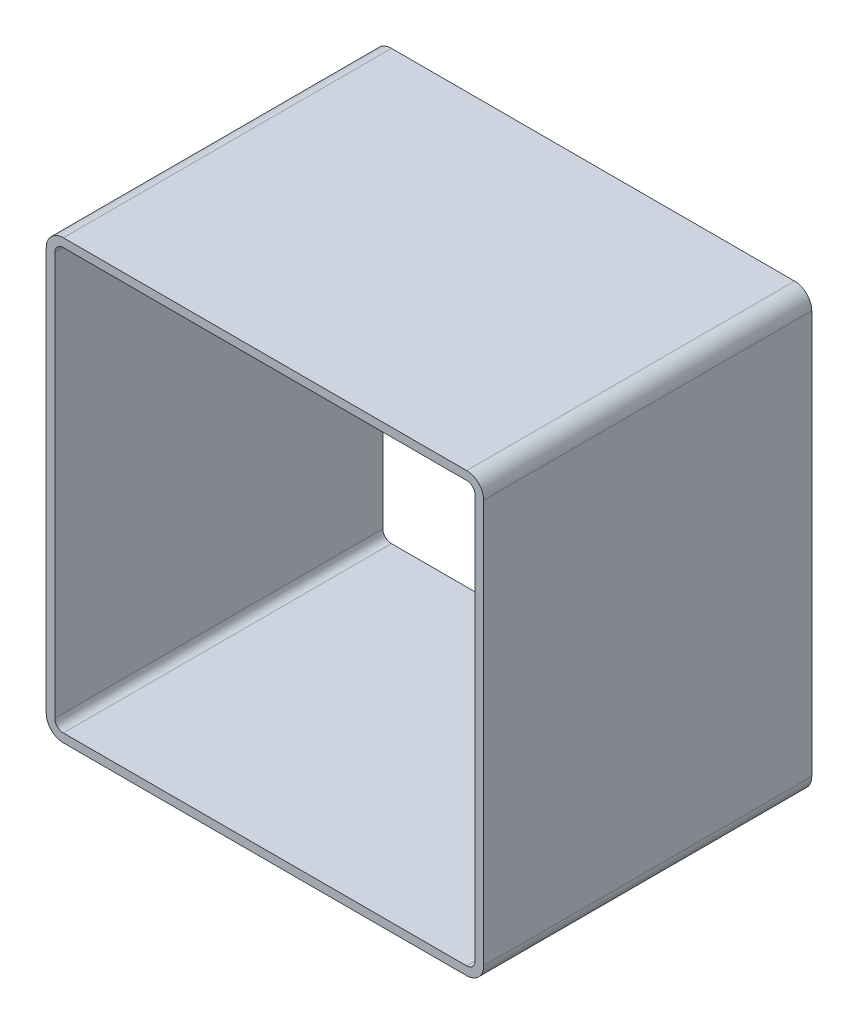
ISO-10303-21;
HEADER;
FILE_DESCRIPTION(('STEP AP214'),'2;1');
FILE_NAME('part.step','',(''),(''),'','','');
FILE_SCHEMA(('AUTOMOTIVE_DESIGN { 1 0 10303 214 1 1 1 1 }'));
ENDSEC;
DATA;
#1=APPLICATION_CONTEXT('core data for automotive mechanical design processes');
#2=APPLICATION_PROTOCOL_DEFINITION('international standard','automotive_design',2000,#1);
#3=PRODUCT_CONTEXT('',#1,'mechanical');
#4=PRODUCT('Part','Part','',(#3));
#5=PRODUCT_RELATED_PRODUCT_CATEGORY('part','',(#4));
#6=PRODUCT_DEFINITION_FORMATION('','',#4);
#7=PRODUCT_DEFINITION_CONTEXT('part definition',#1,'design');
#8=PRODUCT_DEFINITION('design','',#6,#7);
#9=PRODUCT_DEFINITION_SHAPE('','',#8);
#10=(LENGTH_UNIT() NAMED_UNIT(*) SI_UNIT(.MILLI.,.METRE.));
#11=(NAMED_UNIT(*) PLANE_ANGLE_UNIT() SI_UNIT($,.RADIAN.));
#12=(NAMED_UNIT(*) SI_UNIT($,.STERADIAN.) SOLID_ANGLE_UNIT());
#13=UNCERTAINTY_MEASURE_WITH_UNIT(LENGTH_MEASURE(1.E-05),#10,'distance_accuracy_value','');
#14=(GEOMETRIC_REPRESENTATION_CONTEXT(3) GLOBAL_UNCERTAINTY_ASSIGNED_CONTEXT((#13)) GLOBAL_UNIT_ASSIGNED_CONTEXT((#10,
#11,#12)) REPRESENTATION_CONTEXT('',''));
#15=CARTESIAN_POINT('',(0.,0.,0.));
#16=DIRECTION('',(0.,0.,1.));
#17=DIRECTION('',(1.,0.,0.));
#18=AXIS2_PLACEMENT_3D('',#15,#16,#17);
#19=CARTESIAN_POINT('',(16.697465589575,392.307862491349,304.8));
#20=DIRECTION('',(0.,0.,1.));
#21=DIRECTION('',(1.,0.,0.));
#22=AXIS2_PLACEMENT_3D('',#19,#20,#21);
#23=PLANE('',#22);
#24=CARTESIAN_POINT('',(16.697465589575,392.307862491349,304.8));
#25=DIRECTION('',(0.,0.,1.));
#26=DIRECTION('',(1.,0.,0.));
#27=AXIS2_PLACEMENT_3D('',#24,#25,#26);
#28=CIRCLE('',#27,15.875);
#29=CARTESIAN_POINT('',(16.697465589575,408.182862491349,304.8));
#30=VERTEX_POINT('',#29);
#31=CARTESIAN_POINT('',(0.82246558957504,392.307862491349,304.8));
#32=VERTEX_POINT('',#31);
#33=EDGE_CURVE('E211',#30,#32,#28,.T.);
#34=ORIENTED_EDGE('',*,*,#33,.T.);
#35=DIRECTION('',(0.,-1.,0.));
#36=VECTOR('',#35,1.);
#37=CARTESIAN_POINT('',(0.82246558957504,17.6578624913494,304.8));
#38=LINE('',#37,#36);
#39=CARTESIAN_POINT('',(0.822465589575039,17.6578624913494,304.8));
#40=VERTEX_POINT('',#39);
#41=EDGE_CURVE('E214',#32,#40,#38,.T.);
#42=ORIENTED_EDGE('',*,*,#41,.T.);
#43=CARTESIAN_POINT('',(16.697465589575,17.6578624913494,304.8));
#44=DIRECTION('',(0.,0.,1.));
#45=DIRECTION('',(1.,0.,0.));
#46=AXIS2_PLACEMENT_3D('',#43,#44,#45);
#47=CIRCLE('',#46,15.875);
#48=CARTESIAN_POINT('',(16.697465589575,1.78286249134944,304.8));
#49=VERTEX_POINT('',#48);
#50=EDGE_CURVE('E217',#40,#49,#47,.T.);
#51=ORIENTED_EDGE('',*,*,#50,.T.);
#52=DIRECTION('',(1.,0.,0.));
#53=VECTOR('',#52,1.);
#54=CARTESIAN_POINT('',(391.347465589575,1.78286249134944,304.8));
#55=LINE('',#54,#53);
#56=CARTESIAN_POINT('',(391.347465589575,1.78286249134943,304.8));
#57=VERTEX_POINT('',#56);
#58=EDGE_CURVE('E219',#49,#57,#55,.T.);
#59=ORIENTED_EDGE('',*,*,#58,.T.);
#60=CARTESIAN_POINT('',(391.347465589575,17.6578624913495,304.8));
#61=DIRECTION('',(0.,0.,1.));
#62=DIRECTION('',(1.,0.,0.));
#63=AXIS2_PLACEMENT_3D('',#60,#61,#62);
#64=CIRCLE('',#63,15.875);
#65=CARTESIAN_POINT('',(407.222465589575,17.6578624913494,304.8));
#66=VERTEX_POINT('',#65);
#67=EDGE_CURVE('E221',#57,#66,#64,.T.);
#68=ORIENTED_EDGE('',*,*,#67,.T.);
#69=DIRECTION('',(0.,1.,0.));
#70=VECTOR('',#69,1.);
#71=CARTESIAN_POINT('',(407.222465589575,392.307862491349,304.8));
#72=LINE('',#71,#70);
#73=CARTESIAN_POINT('',(407.222465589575,392.307862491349,304.8));
#74=VERTEX_POINT('',#73);
#75=EDGE_CURVE('E223',#66,#74,#72,.T.);
#76=ORIENTED_EDGE('',*,*,#75,.T.);
#77=CARTESIAN_POINT('',(391.347465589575,392.307862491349,304.8));
#78=DIRECTION('',(0.,0.,1.));
#79=DIRECTION('',(1.,0.,0.));
#80=AXIS2_PLACEMENT_3D('',#77,#78,#79);
#81=CIRCLE('',#80,15.875);
#82=CARTESIAN_POINT('',(391.347465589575,408.182862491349,304.8));
#83=VERTEX_POINT('',#82);
#84=EDGE_CURVE('E225',#74,#83,#81,.T.);
#85=ORIENTED_EDGE('',*,*,#84,.T.);
#86=DIRECTION('',(-1.,0.,0.));
#87=VECTOR('',#86,1.);
#88=CARTESIAN_POINT('',(16.697465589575,408.182862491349,304.8));
#89=LINE('',#88,#87);
#90=EDGE_CURVE('E227',#83,#30,#89,.T.);
#91=ORIENTED_EDGE('',*,*,#90,.T.);
#92=EDGE_LOOP('',(#34,#42,#51,#59,#68,#76,#85,#91));
#93=FACE_BOUND('',#92,.T.);
#94=DIRECTION('',(0.,-1.,0.));
#95=VECTOR('',#94,1.);
#96=CARTESIAN_POINT('',(8.75996558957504,17.6578624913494,304.8));
#97=LINE('',#96,#95);
#98=CARTESIAN_POINT('',(8.75996558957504,392.307862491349,304.8));
#99=VERTEX_POINT('',#98);
#100=CARTESIAN_POINT('',(8.75996558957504,17.6578624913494,304.8));
#101=VERTEX_POINT('',#100);
#102=EDGE_CURVE('E154',#99,#101,#97,.T.);
#103=ORIENTED_EDGE('',*,*,#102,.F.);
#104=CARTESIAN_POINT('',(16.697465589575,392.307862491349,304.8));
#105=DIRECTION('',(0.,0.,1.));
#106=DIRECTION('',(1.,0.,0.));
#107=AXIS2_PLACEMENT_3D('',#104,#105,#106);
#108=CIRCLE('',#107,7.93749999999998);
#109=CARTESIAN_POINT('',(16.697465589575,400.245362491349,304.8));
#110=VERTEX_POINT('',#109);
#111=EDGE_CURVE('E146',#110,#99,#108,.T.);
#112=ORIENTED_EDGE('',*,*,#111,.F.);
#113=DIRECTION('',(-1.,0.,0.));
#114=VECTOR('',#113,1.);
#115=CARTESIAN_POINT('',(16.697465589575,400.245362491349,304.8));
#116=LINE('',#115,#114);
#117=CARTESIAN_POINT('',(391.347465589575,400.245362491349,304.8));
#118=VERTEX_POINT('',#117);
#119=EDGE_CURVE('E179',#118,#110,#116,.T.);
#120=ORIENTED_EDGE('',*,*,#119,.F.);
#121=CARTESIAN_POINT('',(391.347465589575,392.307862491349,304.8));
#122=DIRECTION('',(0.,0.,1.));
#123=DIRECTION('',(1.,0.,0.));
#124=AXIS2_PLACEMENT_3D('',#121,#122,#123);
#125=CIRCLE('',#124,7.93749999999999);
#126=CARTESIAN_POINT('',(399.284965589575,392.307862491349,304.8));
#127=VERTEX_POINT('',#126);
#128=EDGE_CURVE('E177',#127,#118,#125,.T.);
#129=ORIENTED_EDGE('',*,*,#128,.F.);
#130=DIRECTION('',(0.,1.,0.));
#131=VECTOR('',#130,1.);
#132=CARTESIAN_POINT('',(399.284965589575,392.307862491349,304.8));
#133=LINE('',#132,#131);
#134=CARTESIAN_POINT('',(399.284965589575,17.6578624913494,304.8));
#135=VERTEX_POINT('',#134);
#136=EDGE_CURVE('E175',#135,#127,#133,.T.);
#137=ORIENTED_EDGE('',*,*,#136,.F.);
#138=CARTESIAN_POINT('',(391.347465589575,17.6578624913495,304.8));
#139=DIRECTION('',(0.,0.,1.));
#140=DIRECTION('',(1.,0.,0.));
#141=AXIS2_PLACEMENT_3D('',#138,#139,#140);
#142=CIRCLE('',#141,7.9375);
#143=CARTESIAN_POINT('',(391.347465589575,9.72036249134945,304.8));
#144=VERTEX_POINT('',#143);
#145=EDGE_CURVE('E173',#144,#135,#142,.T.);
#146=ORIENTED_EDGE('',*,*,#145,.F.);
#147=DIRECTION('',(1.,0.,0.));
#148=VECTOR('',#147,1.);
#149=CARTESIAN_POINT('',(391.347465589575,9.72036249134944,304.8));
#150=LINE('',#149,#148);
#151=CARTESIAN_POINT('',(16.697465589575,9.72036249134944,304.8));
#152=VERTEX_POINT('',#151);
#153=EDGE_CURVE('E169',#152,#144,#150,.T.);
#154=ORIENTED_EDGE('',*,*,#153,.F.);
#155=CARTESIAN_POINT('',(16.697465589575,17.6578624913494,304.8));
#156=DIRECTION('',(0.,0.,1.));
#157=DIRECTION('',(1.,0.,0.));
#158=AXIS2_PLACEMENT_3D('',#155,#156,#157);
#159=CIRCLE('',#158,7.9375);
#160=EDGE_CURVE('E167',#101,#152,#159,.T.);
#161=ORIENTED_EDGE('',*,*,#160,.F.);
#162=EDGE_LOOP('',(#103,#112,#120,#129,#137,#146,#154,#161));
#163=FACE_BOUND('',#162,.T.);
#164=ADVANCED_FACE('F33',(#93,#163),#23,.T.);
#165=CARTESIAN_POINT('',(16.697465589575,392.307862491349,0.));
#166=DIRECTION('',(0.,0.,1.));
#167=DIRECTION('',(1.,0.,0.));
#168=AXIS2_PLACEMENT_3D('',#165,#166,#167);
#169=PLANE('',#168);
#170=CARTESIAN_POINT('',(16.697465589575,392.307862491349,0.));
#171=DIRECTION('',(0.,0.,1.));
#172=DIRECTION('',(1.,0.,0.));
#173=AXIS2_PLACEMENT_3D('',#170,#171,#172);
#174=CIRCLE('',#173,15.875);
#175=CARTESIAN_POINT('',(16.697465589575,408.182862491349,0.));
#176=VERTEX_POINT('',#175);
#177=CARTESIAN_POINT('',(0.82246558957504,392.307862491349,0.));
#178=VERTEX_POINT('',#177);
#179=EDGE_CURVE('E162',#176,#178,#174,.T.);
#180=ORIENTED_EDGE('',*,*,#179,.F.);
#181=DIRECTION('',(-1.,0.,0.));
#182=VECTOR('',#181,1.);
#183=CARTESIAN_POINT('',(16.697465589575,408.182862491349,0.));
#184=LINE('',#183,#182);
#185=CARTESIAN_POINT('',(391.347465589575,408.182862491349,0.));
#186=VERTEX_POINT('',#185);
#187=EDGE_CURVE('E215',#186,#176,#184,.T.);
#188=ORIENTED_EDGE('',*,*,#187,.F.);
#189=CARTESIAN_POINT('',(391.347465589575,392.307862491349,0.));
#190=DIRECTION('',(0.,0.,1.));
#191=DIRECTION('',(1.,0.,0.));
#192=AXIS2_PLACEMENT_3D('',#189,#190,#191);
#193=CIRCLE('',#192,15.875);
#194=CARTESIAN_POINT('',(407.222465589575,392.307862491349,0.));
#195=VERTEX_POINT('',#194);
#196=EDGE_CURVE('E242',#195,#186,#193,.T.);
#197=ORIENTED_EDGE('',*,*,#196,.F.);
#198=DIRECTION('',(0.,1.,0.));
#199=VECTOR('',#198,1.);
#200=CARTESIAN_POINT('',(407.222465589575,392.307862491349,0.));
#201=LINE('',#200,#199);
#202=CARTESIAN_POINT('',(407.222465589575,17.6578624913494,0.));
#203=VERTEX_POINT('',#202);
#204=EDGE_CURVE('E240',#203,#195,#201,.T.);
#205=ORIENTED_EDGE('',*,*,#204,.F.);
#206=CARTESIAN_POINT('',(391.347465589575,17.6578624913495,0.));
#207=DIRECTION('',(0.,0.,1.));
#208=DIRECTION('',(1.,0.,0.));
#209=AXIS2_PLACEMENT_3D('',#206,#207,#208);
#210=CIRCLE('',#209,15.875);
#211=CARTESIAN_POINT('',(391.347465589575,1.78286249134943,0.));
#212=VERTEX_POINT('',#211);
#213=EDGE_CURVE('E238',#212,#203,#210,.T.);
#214=ORIENTED_EDGE('',*,*,#213,.F.);
#215=DIRECTION('',(1.,0.,0.));
#216=VECTOR('',#215,1.);
#217=CARTESIAN_POINT('',(391.347465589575,1.78286249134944,0.));
#218=LINE('',#217,#216);
#219=CARTESIAN_POINT('',(16.697465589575,1.78286249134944,0.));
#220=VERTEX_POINT('',#219);
#221=EDGE_CURVE('E236',#220,#212,#218,.T.);
#222=ORIENTED_EDGE('',*,*,#221,.F.);
#223=CARTESIAN_POINT('',(16.697465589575,17.6578624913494,0.));
#224=DIRECTION('',(0.,0.,1.));
#225=DIRECTION('',(1.,0.,0.));
#226=AXIS2_PLACEMENT_3D('',#223,#224,#225);
#227=CIRCLE('',#226,15.875);
#228=CARTESIAN_POINT('',(0.822465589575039,17.6578624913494,0.));
#229=VERTEX_POINT('',#228);
#230=EDGE_CURVE('E234',#229,#220,#227,.T.);
#231=ORIENTED_EDGE('',*,*,#230,.F.);
#232=DIRECTION('',(0.,-1.,0.));
#233=VECTOR('',#232,1.);
#234=CARTESIAN_POINT('',(0.82246558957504,17.6578624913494,0.));
#235=LINE('',#234,#233);
#236=EDGE_CURVE('E232',#178,#229,#235,.T.);
#237=ORIENTED_EDGE('',*,*,#236,.F.);
#238=EDGE_LOOP('',(#180,#188,#197,#205,#214,#222,#231,#237));
#239=FACE_BOUND('',#238,.T.);
#240=CARTESIAN_POINT('',(16.697465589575,392.307862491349,0.));
#241=DIRECTION('',(0.,0.,1.));
#242=DIRECTION('',(1.,0.,0.));
#243=AXIS2_PLACEMENT_3D('',#240,#241,#242);
#244=CIRCLE('',#243,7.93749999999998);
#245=CARTESIAN_POINT('',(16.697465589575,400.245362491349,0.));
#246=VERTEX_POINT('',#245);
#247=CARTESIAN_POINT('',(8.75996558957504,392.307862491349,0.));
#248=VERTEX_POINT('',#247);
#249=EDGE_CURVE('E56',#246,#248,#244,.T.);
#250=ORIENTED_EDGE('',*,*,#249,.T.);
#251=DIRECTION('',(0.,-1.,0.));
#252=VECTOR('',#251,1.);
#253=CARTESIAN_POINT('',(8.75996558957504,17.6578624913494,0.));
#254=LINE('',#253,#252);
#255=CARTESIAN_POINT('',(8.75996558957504,17.6578624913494,0.));
#256=VERTEX_POINT('',#255);
#257=EDGE_CURVE('E161',#248,#256,#254,.T.);
#258=ORIENTED_EDGE('',*,*,#257,.T.);
#259=CARTESIAN_POINT('',(16.697465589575,17.6578624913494,0.));
#260=DIRECTION('',(0.,0.,1.));
#261=DIRECTION('',(1.,0.,0.));
#262=AXIS2_PLACEMENT_3D('',#259,#260,#261);
#263=CIRCLE('',#262,7.9375);
#264=CARTESIAN_POINT('',(16.697465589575,9.72036249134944,0.));
#265=VERTEX_POINT('',#264);
#266=EDGE_CURVE('E183',#256,#265,#263,.T.);
#267=ORIENTED_EDGE('',*,*,#266,.T.);
#268=DIRECTION('',(1.,0.,0.));
#269=VECTOR('',#268,1.);
#270=CARTESIAN_POINT('',(391.347465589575,9.72036249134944,0.));
#271=LINE('',#270,#269);
#272=CARTESIAN_POINT('',(391.347465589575,9.72036249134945,0.));
#273=VERTEX_POINT('',#272);
#274=EDGE_CURVE('E186',#265,#273,#271,.T.);
#275=ORIENTED_EDGE('',*,*,#274,.T.);
#276=CARTESIAN_POINT('',(391.347465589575,17.6578624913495,0.));
#277=DIRECTION('',(0.,0.,1.));
#278=DIRECTION('',(1.,0.,0.));
#279=AXIS2_PLACEMENT_3D('',#276,#277,#278);
#280=CIRCLE('',#279,7.9375);
#281=CARTESIAN_POINT('',(399.284965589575,17.6578624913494,0.));
#282=VERTEX_POINT('',#281);
#283=EDGE_CURVE('E189',#273,#282,#280,.T.);
#284=ORIENTED_EDGE('',*,*,#283,.T.);
#285=DIRECTION('',(0.,1.,0.));
#286=VECTOR('',#285,1.);
#287=CARTESIAN_POINT('',(399.284965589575,392.307862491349,0.));
#288=LINE('',#287,#286);
#289=CARTESIAN_POINT('',(399.284965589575,392.307862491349,0.));
#290=VERTEX_POINT('',#289);
#291=EDGE_CURVE('E192',#282,#290,#288,.T.);
#292=ORIENTED_EDGE('',*,*,#291,.T.);
#293=CARTESIAN_POINT('',(391.347465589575,392.307862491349,0.));
#294=DIRECTION('',(0.,0.,1.));
#295=DIRECTION('',(1.,0.,0.));
#296=AXIS2_PLACEMENT_3D('',#293,#294,#295);
#297=CIRCLE('',#296,7.93749999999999);
#298=CARTESIAN_POINT('',(391.347465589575,400.245362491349,0.));
#299=VERTEX_POINT('',#298);
#300=EDGE_CURVE('E195',#290,#299,#297,.T.);
#301=ORIENTED_EDGE('',*,*,#300,.T.);
#302=DIRECTION('',(-1.,0.,0.));
#303=VECTOR('',#302,1.);
#304=CARTESIAN_POINT('',(16.697465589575,400.245362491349,0.));
#305=LINE('',#304,#303);
#306=EDGE_CURVE('E155',#299,#246,#305,.T.);
#307=ORIENTED_EDGE('',*,*,#306,.T.);
#308=EDGE_LOOP('',(#250,#258,#267,#275,#284,#292,#301,#307));
#309=FACE_BOUND('',#308,.T.);
#310=ADVANCED_FACE('F272',(#239,#309),#169,.F.);
#311=CARTESIAN_POINT('',(16.697465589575,392.307862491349,304.8));
#312=DIRECTION('',(0.,0.,-1.));
#313=DIRECTION('',(-1.,0.,0.));
#314=AXIS2_PLACEMENT_3D('',#311,#312,#313);
#315=CYLINDRICAL_SURFACE('',#314,15.875);
#316=ORIENTED_EDGE('',*,*,#179,.T.);
#317=DIRECTION('',(0.,0.,-1.));
#318=VECTOR('',#317,1.);
#319=CARTESIAN_POINT('',(0.82246558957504,392.307862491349,304.8));
#320=LINE('',#319,#318);
#321=EDGE_CURVE('E11',#32,#178,#320,.T.);
#322=ORIENTED_EDGE('',*,*,#321,.F.);
#323=ORIENTED_EDGE('',*,*,#33,.F.);
#324=DIRECTION('',(0.,0.,-1.));
#325=VECTOR('',#324,1.);
#326=CARTESIAN_POINT('',(16.697465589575,408.182862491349,304.8));
#327=LINE('',#326,#325);
#328=EDGE_CURVE('E229',#30,#176,#327,.T.);
#329=ORIENTED_EDGE('',*,*,#328,.T.);
#330=EDGE_LOOP('',(#316,#322,#323,#329));
#331=FACE_BOUND('',#330,.T.);
#332=ADVANCED_FACE('F35',(#331),#315,.T.);
#333=CARTESIAN_POINT('',(0.82246558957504,17.6578624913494,304.8));
#334=DIRECTION('',(1.,0.,0.));
#335=DIRECTION('',(0.,0.,-1.));
#336=AXIS2_PLACEMENT_3D('',#333,#334,#335);
#337=PLANE('',#336);
#338=ORIENTED_EDGE('',*,*,#236,.T.);
#339=DIRECTION('',(0.,0.,-1.));
#340=VECTOR('',#339,1.);
#341=CARTESIAN_POINT('',(0.822465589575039,17.6578624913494,304.8));
#342=LINE('',#341,#340);
#343=EDGE_CURVE('E41',#40,#229,#342,.T.);
#344=ORIENTED_EDGE('',*,*,#343,.F.);
#345=ORIENTED_EDGE('',*,*,#41,.F.);
#346=ORIENTED_EDGE('',*,*,#321,.T.);
#347=EDGE_LOOP('',(#338,#344,#345,#346));
#348=FACE_BOUND('',#347,.T.);
#349=ADVANCED_FACE('F289',(#348),#337,.F.);
#350=CARTESIAN_POINT('',(16.697465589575,17.6578624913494,304.8));
#351=DIRECTION('',(0.,0.,-1.));
#352=DIRECTION('',(-1.,0.,0.));
#353=AXIS2_PLACEMENT_3D('',#350,#351,#352);
#354=CYLINDRICAL_SURFACE('',#353,15.875);
#355=ORIENTED_EDGE('',*,*,#230,.T.);
#356=DIRECTION('',(0.,0.,-1.));
#357=VECTOR('',#356,1.);
#358=CARTESIAN_POINT('',(16.697465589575,1.78286249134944,304.8));
#359=LINE('',#358,#357);
#360=EDGE_CURVE('E259',#49,#220,#359,.T.);
#361=ORIENTED_EDGE('',*,*,#360,.F.);
#362=ORIENTED_EDGE('',*,*,#50,.F.);
#363=ORIENTED_EDGE('',*,*,#343,.T.);
#364=EDGE_LOOP('',(#355,#361,#362,#363));
#365=FACE_BOUND('',#364,.T.);
#366=ADVANCED_FACE('F266',(#365),#354,.T.);
#367=CARTESIAN_POINT('',(391.347465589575,1.78286249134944,304.8));
#368=DIRECTION('',(0.,1.,0.));
#369=DIRECTION('',(0.,0.,1.));
#370=AXIS2_PLACEMENT_3D('',#367,#368,#369);
#371=PLANE('',#370);
#372=ORIENTED_EDGE('',*,*,#221,.T.);
#373=DIRECTION('',(0.,0.,-1.));
#374=VECTOR('',#373,1.);
#375=CARTESIAN_POINT('',(391.347465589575,1.78286249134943,304.8));
#376=LINE('',#375,#374);
#377=EDGE_CURVE('E256',#57,#212,#376,.T.);
#378=ORIENTED_EDGE('',*,*,#377,.F.);
#379=ORIENTED_EDGE('',*,*,#58,.F.);
#380=ORIENTED_EDGE('',*,*,#360,.T.);
#381=EDGE_LOOP('',(#372,#378,#379,#380));
#382=FACE_BOUND('',#381,.T.);
#383=ADVANCED_FACE('F278',(#382),#371,.F.);
#384=CARTESIAN_POINT('',(391.347465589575,17.6578624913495,304.8));
#385=DIRECTION('',(0.,0.,-1.));
#386=DIRECTION('',(-1.,0.,0.));
#387=AXIS2_PLACEMENT_3D('',#384,#385,#386);
#388=CYLINDRICAL_SURFACE('',#387,15.875);
#389=ORIENTED_EDGE('',*,*,#213,.T.);
#390=DIRECTION('',(0.,0.,-1.));
#391=VECTOR('',#390,1.);
#392=CARTESIAN_POINT('',(407.222465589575,17.6578624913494,304.8));
#393=LINE('',#392,#391);
#394=EDGE_CURVE('E253',#66,#203,#393,.T.);
#395=ORIENTED_EDGE('',*,*,#394,.F.);
#396=ORIENTED_EDGE('',*,*,#67,.F.);
#397=ORIENTED_EDGE('',*,*,#377,.T.);
#398=EDGE_LOOP('',(#389,#395,#396,#397));
#399=FACE_BOUND('',#398,.T.);
#400=ADVANCED_FACE('F282',(#399),#388,.T.);
#401=CARTESIAN_POINT('',(407.222465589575,392.307862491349,304.8));
#402=DIRECTION('',(-1.,0.,0.));
#403=DIRECTION('',(0.,0.,1.));
#404=AXIS2_PLACEMENT_3D('',#401,#402,#403);
#405=PLANE('',#404);
#406=ORIENTED_EDGE('',*,*,#204,.T.);
#407=DIRECTION('',(0.,0.,-1.));
#408=VECTOR('',#407,1.);
#409=CARTESIAN_POINT('',(407.222465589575,392.307862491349,304.8));
#410=LINE('',#409,#408);
#411=EDGE_CURVE('E250',#74,#195,#410,.T.);
#412=ORIENTED_EDGE('',*,*,#411,.F.);
#413=ORIENTED_EDGE('',*,*,#75,.F.);
#414=ORIENTED_EDGE('',*,*,#394,.T.);
#415=EDGE_LOOP('',(#406,#412,#413,#414));
#416=FACE_BOUND('',#415,.T.);
#417=ADVANCED_FACE('F302',(#416),#405,.F.);
#418=CARTESIAN_POINT('',(391.347465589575,392.307862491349,304.8));
#419=DIRECTION('',(0.,0.,-1.));
#420=DIRECTION('',(-1.,0.,0.));
#421=AXIS2_PLACEMENT_3D('',#418,#419,#420);
#422=CYLINDRICAL_SURFACE('',#421,15.875);
#423=ORIENTED_EDGE('',*,*,#196,.T.);
#424=DIRECTION('',(0.,0.,-1.));
#425=VECTOR('',#424,1.);
#426=CARTESIAN_POINT('',(391.347465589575,408.182862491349,304.8));
#427=LINE('',#426,#425);
#428=EDGE_CURVE('E247',#83,#186,#427,.T.);
#429=ORIENTED_EDGE('',*,*,#428,.F.);
#430=ORIENTED_EDGE('',*,*,#84,.F.);
#431=ORIENTED_EDGE('',*,*,#411,.T.);
#432=EDGE_LOOP('',(#423,#429,#430,#431));
#433=FACE_BOUND('',#432,.T.);
#434=ADVANCED_FACE('F300',(#433),#422,.T.);
#435=CARTESIAN_POINT('',(16.697465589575,408.182862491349,304.8));
#436=DIRECTION('',(0.,-1.,0.));
#437=DIRECTION('',(0.,0.,-1.));
#438=AXIS2_PLACEMENT_3D('',#435,#436,#437);
#439=PLANE('',#438);
#440=ORIENTED_EDGE('',*,*,#187,.T.);
#441=ORIENTED_EDGE('',*,*,#328,.F.);
#442=ORIENTED_EDGE('',*,*,#90,.F.);
#443=ORIENTED_EDGE('',*,*,#428,.T.);
#444=EDGE_LOOP('',(#440,#441,#442,#443));
#445=FACE_BOUND('',#444,.T.);
#446=ADVANCED_FACE('F295',(#445),#439,.F.);
#447=CARTESIAN_POINT('',(16.697465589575,392.307862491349,304.8));
#448=DIRECTION('',(0.,0.,-1.));
#449=DIRECTION('',(-1.,0.,0.));
#450=AXIS2_PLACEMENT_3D('',#447,#448,#449);
#451=CYLINDRICAL_SURFACE('',#450,7.93749999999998);
#452=ORIENTED_EDGE('',*,*,#249,.F.);
#453=DIRECTION('',(0.,0.,-1.));
#454=VECTOR('',#453,1.);
#455=CARTESIAN_POINT('',(16.697465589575,400.245362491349,304.8));
#456=LINE('',#455,#454);
#457=EDGE_CURVE('E150',#110,#246,#456,.T.);
#458=ORIENTED_EDGE('',*,*,#457,.F.);
#459=ORIENTED_EDGE('',*,*,#111,.T.);
#460=DIRECTION('',(0.,0.,-1.));
#461=VECTOR('',#460,1.);
#462=CARTESIAN_POINT('',(8.75996558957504,392.307862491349,304.8));
#463=LINE('',#462,#461);
#464=EDGE_CURVE('E149',#99,#248,#463,.T.);
#465=ORIENTED_EDGE('',*,*,#464,.T.);
#466=EDGE_LOOP('',(#452,#458,#459,#465));
#467=FACE_BOUND('',#466,.T.);
#468=ADVANCED_FACE('F148',(#467),#451,.F.);
#469=CARTESIAN_POINT('',(8.75996558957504,17.6578624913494,304.8));
#470=DIRECTION('',(1.,0.,0.));
#471=DIRECTION('',(0.,0.,-1.));
#472=AXIS2_PLACEMENT_3D('',#469,#470,#471);
#473=PLANE('',#472);
#474=ORIENTED_EDGE('',*,*,#257,.F.);
#475=ORIENTED_EDGE('',*,*,#464,.F.);
#476=ORIENTED_EDGE('',*,*,#102,.T.);
#477=DIRECTION('',(0.,0.,-1.));
#478=VECTOR('',#477,1.);
#479=CARTESIAN_POINT('',(8.75996558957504,17.6578624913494,304.8));
#480=LINE('',#479,#478);
#481=EDGE_CURVE('E163',#101,#256,#480,.T.);
#482=ORIENTED_EDGE('',*,*,#481,.T.);
#483=EDGE_LOOP('',(#474,#475,#476,#482));
#484=FACE_BOUND('',#483,.T.);
#485=ADVANCED_FACE('F158',(#484),#473,.T.);
#486=CARTESIAN_POINT('',(16.697465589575,17.6578624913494,304.8));
#487=DIRECTION('',(0.,0.,-1.));
#488=DIRECTION('',(-1.,0.,0.));
#489=AXIS2_PLACEMENT_3D('',#486,#487,#488);
#490=CYLINDRICAL_SURFACE('',#489,7.9375);
#491=ORIENTED_EDGE('',*,*,#266,.F.);
#492=ORIENTED_EDGE('',*,*,#481,.F.);
#493=ORIENTED_EDGE('',*,*,#160,.T.);
#494=DIRECTION('',(0.,0.,-1.));
#495=VECTOR('',#494,1.);
#496=CARTESIAN_POINT('',(16.697465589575,9.72036249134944,304.8));
#497=LINE('',#496,#495);
#498=EDGE_CURVE('E208',#152,#265,#497,.T.);
#499=ORIENTED_EDGE('',*,*,#498,.T.);
#500=EDGE_LOOP('',(#491,#492,#493,#499));
#501=FACE_BOUND('',#500,.T.);
#502=ADVANCED_FACE('F327',(#501),#490,.F.);
#503=CARTESIAN_POINT('',(391.347465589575,9.72036249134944,304.8));
#504=DIRECTION('',(0.,1.,0.));
#505=DIRECTION('',(0.,0.,1.));
#506=AXIS2_PLACEMENT_3D('',#503,#504,#505);
#507=PLANE('',#506);
#508=ORIENTED_EDGE('',*,*,#274,.F.);
#509=ORIENTED_EDGE('',*,*,#498,.F.);
#510=ORIENTED_EDGE('',*,*,#153,.T.);
#511=DIRECTION('',(0.,0.,-1.));
#512=VECTOR('',#511,1.);
#513=CARTESIAN_POINT('',(391.347465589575,9.72036249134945,304.8));
#514=LINE('',#513,#512);
#515=EDGE_CURVE('E206',#144,#273,#514,.T.);
#516=ORIENTED_EDGE('',*,*,#515,.T.);
#517=EDGE_LOOP('',(#508,#509,#510,#516));
#518=FACE_BOUND('',#517,.T.);
#519=ADVANCED_FACE('F331',(#518),#507,.T.);
#520=CARTESIAN_POINT('',(391.347465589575,17.6578624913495,304.8));
#521=DIRECTION('',(0.,0.,-1.));
#522=DIRECTION('',(-1.,0.,0.));
#523=AXIS2_PLACEMENT_3D('',#520,#521,#522);
#524=CYLINDRICAL_SURFACE('',#523,7.9375);
#525=ORIENTED_EDGE('',*,*,#283,.F.);
#526=ORIENTED_EDGE('',*,*,#515,.F.);
#527=ORIENTED_EDGE('',*,*,#145,.T.);
#528=DIRECTION('',(0.,0.,-1.));
#529=VECTOR('',#528,1.);
#530=CARTESIAN_POINT('',(399.284965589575,17.6578624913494,304.8));
#531=LINE('',#530,#529);
#532=EDGE_CURVE('E204',#135,#282,#531,.T.);
#533=ORIENTED_EDGE('',*,*,#532,.T.);
#534=EDGE_LOOP('',(#525,#526,#527,#533));
#535=FACE_BOUND('',#534,.T.);
#536=ADVANCED_FACE('F337',(#535),#524,.F.);
#537=CARTESIAN_POINT('',(399.284965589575,392.307862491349,304.8));
#538=DIRECTION('',(-1.,0.,0.));
#539=DIRECTION('',(0.,0.,1.));
#540=AXIS2_PLACEMENT_3D('',#537,#538,#539);
#541=PLANE('',#540);
#542=ORIENTED_EDGE('',*,*,#291,.F.);
#543=ORIENTED_EDGE('',*,*,#532,.F.);
#544=ORIENTED_EDGE('',*,*,#136,.T.);
#545=DIRECTION('',(0.,0.,-1.));
#546=VECTOR('',#545,1.);
#547=CARTESIAN_POINT('',(399.284965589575,392.307862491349,304.8));
#548=LINE('',#547,#546);
#549=EDGE_CURVE('E202',#127,#290,#548,.T.);
#550=ORIENTED_EDGE('',*,*,#549,.T.);
#551=EDGE_LOOP('',(#542,#543,#544,#550));
#552=FACE_BOUND('',#551,.T.);
#553=ADVANCED_FACE('F341',(#552),#541,.T.);
#554=CARTESIAN_POINT('',(391.347465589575,392.307862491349,304.8));
#555=DIRECTION('',(0.,0.,-1.));
#556=DIRECTION('',(-1.,0.,0.));
#557=AXIS2_PLACEMENT_3D('',#554,#555,#556);
#558=CYLINDRICAL_SURFACE('',#557,7.93749999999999);
#559=ORIENTED_EDGE('',*,*,#300,.F.);
#560=ORIENTED_EDGE('',*,*,#549,.F.);
#561=ORIENTED_EDGE('',*,*,#128,.T.);
#562=DIRECTION('',(0.,0.,-1.));
#563=VECTOR('',#562,1.);
#564=CARTESIAN_POINT('',(391.347465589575,400.245362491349,304.8));
#565=LINE('',#564,#563);
#566=EDGE_CURVE('E48',#118,#299,#565,.T.);
#567=ORIENTED_EDGE('',*,*,#566,.T.);
#568=EDGE_LOOP('',(#559,#560,#561,#567));
#569=FACE_BOUND('',#568,.T.);
#570=ADVANCED_FACE('F345',(#569),#558,.F.);
#571=CARTESIAN_POINT('',(16.697465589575,400.245362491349,304.8));
#572=DIRECTION('',(0.,-1.,0.));
#573=DIRECTION('',(0.,0.,-1.));
#574=AXIS2_PLACEMENT_3D('',#571,#572,#573);
#575=PLANE('',#574);
#576=ORIENTED_EDGE('',*,*,#306,.F.);
#577=ORIENTED_EDGE('',*,*,#566,.F.);
#578=ORIENTED_EDGE('',*,*,#119,.T.);
#579=ORIENTED_EDGE('',*,*,#457,.T.);
#580=EDGE_LOOP('',(#576,#577,#578,#579));
#581=FACE_BOUND('',#580,.T.);
#582=ADVANCED_FACE('F349',(#581),#575,.T.);
#583=CLOSED_SHELL('',(#164,#310,#332,#349,#366,#383,#400,#417,#434,#446,#468,#485,#502,#519,
#536,#553,#570,#582));
#584=MANIFOLD_SOLID_BREP('B2',#583);
#585=ADVANCED_BREP_SHAPE_REPRESENTATION('',(#18,#584),#14);
#586=SHAPE_DEFINITION_REPRESENTATION(#9,#585);
ENDSEC;
END-ISO-10303-21;
